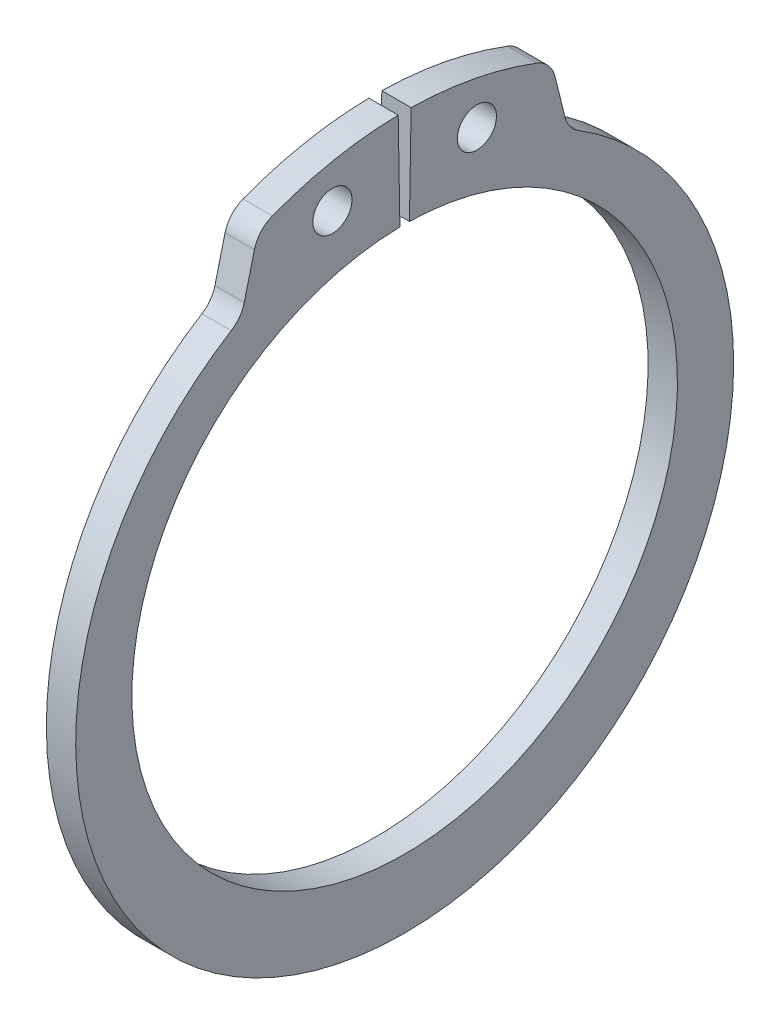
ISO-10303-21;
HEADER;
FILE_DESCRIPTION(('STEP AP214'),'2;1');
FILE_NAME('part.step','',(''),(''),'','','');
FILE_SCHEMA(('AUTOMOTIVE_DESIGN { 1 0 10303 214 1 1 1 1 }'));
ENDSEC;
DATA;
#1=APPLICATION_CONTEXT('core data for automotive mechanical design processes');
#2=APPLICATION_PROTOCOL_DEFINITION('international standard','automotive_design',2000,#1);
#3=PRODUCT_CONTEXT('',#1,'mechanical');
#4=PRODUCT('Part','Part','',(#3));
#5=PRODUCT_RELATED_PRODUCT_CATEGORY('part','',(#4));
#6=PRODUCT_DEFINITION_FORMATION('','',#4);
#7=PRODUCT_DEFINITION_CONTEXT('part definition',#1,'design');
#8=PRODUCT_DEFINITION('design','',#6,#7);
#9=PRODUCT_DEFINITION_SHAPE('','',#8);
#10=(LENGTH_UNIT() NAMED_UNIT(*) SI_UNIT(.MILLI.,.METRE.));
#11=(NAMED_UNIT(*) PLANE_ANGLE_UNIT() SI_UNIT($,.RADIAN.));
#12=(NAMED_UNIT(*) SI_UNIT($,.STERADIAN.) SOLID_ANGLE_UNIT());
#13=UNCERTAINTY_MEASURE_WITH_UNIT(LENGTH_MEASURE(1.E-05),#10,'distance_accuracy_value','');
#14=(GEOMETRIC_REPRESENTATION_CONTEXT(3) GLOBAL_UNCERTAINTY_ASSIGNED_CONTEXT((#13)) GLOBAL_UNIT_ASSIGNED_CONTEXT((#10,
#11,#12)) REPRESENTATION_CONTEXT('',''));
#15=CARTESIAN_POINT('',(0.,0.,0.));
#16=DIRECTION('',(0.,0.,1.));
#17=DIRECTION('',(1.,0.,0.));
#18=AXIS2_PLACEMENT_3D('',#15,#16,#17);
#19=CARTESIAN_POINT('',(0.75,0.,0.));
#20=DIRECTION('',(1.,0.,0.));
#21=DIRECTION('',(0.,0.,-1.));
#22=AXIS2_PLACEMENT_3D('',#19,#20,#21);
#23=PLANE('',#22);
#24=CARTESIAN_POINT('',(0.75,16.3880230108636,3.69421630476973));
#25=DIRECTION('',(1.,0.,0.));
#26=DIRECTION('',(0.,0.,-1.));
#27=AXIS2_PLACEMENT_3D('',#24,#25,#26);
#28=CIRCLE('',#27,1.);
#29=CARTESIAN_POINT('',(0.75,16.3880230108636,2.69421630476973));
#30=VERTEX_POINT('',#29);
#31=EDGE_CURVE('E245',#30,#30,#28,.T.);
#32=ORIENTED_EDGE('',*,*,#31,.F.);
#33=EDGE_LOOP('',(#32));
#34=FACE_BOUND('',#33,.T.);
#35=CARTESIAN_POINT('',(0.75,0.,0.));
#36=DIRECTION('',(1.,0.,0.));
#37=DIRECTION('',(0.,0.,-1.));
#38=AXIS2_PLACEMENT_3D('',#35,#36,#37);
#39=CIRCLE('',#38,18.95);
#40=CARTESIAN_POINT('',(0.75,18.9471138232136,0.330723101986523));
#41=VERTEX_POINT('',#40);
#42=CARTESIAN_POINT('',(0.75,17.7014090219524,6.76480736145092));
#43=VERTEX_POINT('',#42);
#44=EDGE_CURVE('E151',#41,#43,#39,.T.);
#45=ORIENTED_EDGE('',*,*,#44,.T.);
#46=CARTESIAN_POINT('',(0.75,16.3002420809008,6.22933448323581));
#47=DIRECTION('',(1.,0.,0.));
#48=DIRECTION('',(0.,0.,-1.));
#49=AXIS2_PLACEMENT_3D('',#46,#47,#48);
#50=CIRCLE('',#49,1.5);
#51=CARTESIAN_POINT('',(0.75,16.6631249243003,7.68477807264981));
#52=VERTEX_POINT('',#51);
#53=EDGE_CURVE('E192',#43,#52,#50,.T.);
#54=ORIENTED_EDGE('',*,*,#53,.T.);
#55=DIRECTION('',(0.,-0.970295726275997,0.241921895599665));
#56=VECTOR('',#55,1.);
#57=CARTESIAN_POINT('',(0.75,17.4024686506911,7.50043897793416));
#58=LINE('',#57,#56);
#59=CARTESIAN_POINT('',(0.75,14.5823120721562,8.2035829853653));
#60=VERTEX_POINT('',#59);
#61=EDGE_CURVE('E235',#52,#60,#58,.T.);
#62=ORIENTED_EDGE('',*,*,#61,.T.);
#63=CARTESIAN_POINT('',(0.75,14.9451949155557,9.65902657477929));
#64=DIRECTION('',(1.,0.,0.));
#65=DIRECTION('',(0.,0.,-1.));
#66=AXIS2_PLACEMENT_3D('',#63,#64,#65);
#67=CIRCLE('',#66,1.5);
#68=CARTESIAN_POINT('',(0.75,13.6705166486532,8.86833364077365));
#69=VERTEX_POINT('',#68);
#70=EDGE_CURVE('E204',#60,#69,#67,.F.);
#71=ORIENTED_EDGE('',*,*,#70,.T.);
#72=CARTESIAN_POINT('',(0.75,-0.626148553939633,0.));
#73=DIRECTION('',(1.,0.,0.));
#74=DIRECTION('',(0.,0.,-1.));
#75=AXIS2_PLACEMENT_3D('',#72,#73,#74);
#76=CIRCLE('',#75,16.8238514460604);
#77=CARTESIAN_POINT('',(0.75,13.6705166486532,-8.86833364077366));
#78=VERTEX_POINT('',#77);
#79=EDGE_CURVE('E228',#69,#78,#76,.T.);
#80=ORIENTED_EDGE('',*,*,#79,.T.);
#81=CARTESIAN_POINT('',(0.75,14.9451949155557,-9.6590265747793));
#82=DIRECTION('',(1.,0.,0.));
#83=DIRECTION('',(0.,0.,-1.));
#84=AXIS2_PLACEMENT_3D('',#81,#82,#83);
#85=CIRCLE('',#84,1.5);
#86=CARTESIAN_POINT('',(0.75,14.5823120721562,-8.20358298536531));
#87=VERTEX_POINT('',#86);
#88=EDGE_CURVE('E11',#78,#87,#85,.F.);
#89=ORIENTED_EDGE('',*,*,#88,.T.);
#90=DIRECTION('',(0.,0.970295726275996,0.241921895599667));
#91=VECTOR('',#90,1.);
#92=CARTESIAN_POINT('',(0.75,17.4024686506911,-7.50043897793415));
#93=LINE('',#92,#91);
#94=CARTESIAN_POINT('',(0.75,16.6631249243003,-7.6847780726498));
#95=VERTEX_POINT('',#94);
#96=EDGE_CURVE('E227',#87,#95,#93,.T.);
#97=ORIENTED_EDGE('',*,*,#96,.T.);
#98=CARTESIAN_POINT('',(0.75,16.3002420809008,-6.22933448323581));
#99=DIRECTION('',(1.,0.,0.));
#100=DIRECTION('',(0.,0.,-1.));
#101=AXIS2_PLACEMENT_3D('',#98,#99,#100);
#102=CIRCLE('',#101,1.5);
#103=CARTESIAN_POINT('',(0.75,17.7014090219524,-6.76480736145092));
#104=VERTEX_POINT('',#103);
#105=EDGE_CURVE('E59',#95,#104,#102,.T.);
#106=ORIENTED_EDGE('',*,*,#105,.T.);
#107=CARTESIAN_POINT('',(0.75,0.,0.));
#108=DIRECTION('',(1.,0.,0.));
#109=DIRECTION('',(0.,0.,1.));
#110=AXIS2_PLACEMENT_3D('',#107,#108,#109);
#111=CIRCLE('',#110,18.95);
#112=CARTESIAN_POINT('',(0.75,18.9471138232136,-0.330723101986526));
#113=VERTEX_POINT('',#112);
#114=EDGE_CURVE('E231',#104,#113,#111,.T.);
#115=ORIENTED_EDGE('',*,*,#114,.T.);
#116=DIRECTION('',(0.,-0.999847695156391,0.0174524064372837));
#117=VECTOR('',#116,1.);
#118=CARTESIAN_POINT('',(0.75,18.9471138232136,-0.330723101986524));
#119=LINE('',#118,#117);
#120=CARTESIAN_POINT('',(0.75,13.9478753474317,-0.243461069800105));
#121=VERTEX_POINT('',#120);
#122=EDGE_CURVE('E157',#113,#121,#119,.T.);
#123=ORIENTED_EDGE('',*,*,#122,.T.);
#124=CARTESIAN_POINT('',(0.75,0.,0.));
#125=DIRECTION('',(-1.,0.,0.));
#126=DIRECTION('',(0.,0.,-1.));
#127=AXIS2_PLACEMENT_3D('',#124,#125,#126);
#128=CIRCLE('',#127,13.95);
#129=CARTESIAN_POINT('',(0.75,13.9478753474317,0.243461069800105));
#130=VERTEX_POINT('',#129);
#131=EDGE_CURVE('E152',#121,#130,#128,.T.);
#132=ORIENTED_EDGE('',*,*,#131,.T.);
#133=DIRECTION('',(0.,0.999847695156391,0.0174524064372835));
#134=VECTOR('',#133,1.);
#135=CARTESIAN_POINT('',(0.75,13.9478753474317,0.243461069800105));
#136=LINE('',#135,#134);
#137=EDGE_CURVE('E140',#130,#41,#136,.T.);
#138=ORIENTED_EDGE('',*,*,#137,.T.);
#139=EDGE_LOOP('',(#45,#54,#62,#71,#80,#89,#97,#106,#115,#123,#132,#138));
#140=FACE_BOUND('',#139,.T.);
#141=CARTESIAN_POINT('',(0.75,16.3880230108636,-3.69421630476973));
#142=DIRECTION('',(1.,0.,0.));
#143=DIRECTION('',(0.,0.,-1.));
#144=AXIS2_PLACEMENT_3D('',#141,#142,#143);
#145=CIRCLE('',#144,1.);
#146=CARTESIAN_POINT('',(0.75,16.3880230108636,-4.69421630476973));
#147=VERTEX_POINT('',#146);
#148=EDGE_CURVE('E275',#147,#147,#145,.T.);
#149=ORIENTED_EDGE('',*,*,#148,.F.);
#150=EDGE_LOOP('',(#149));
#151=FACE_BOUND('',#150,.T.);
#152=ADVANCED_FACE('F43',(#34,#140,#151),#23,.T.);
#153=CARTESIAN_POINT('',(-0.75,0.,0.));
#154=DIRECTION('',(1.,0.,0.));
#155=DIRECTION('',(0.,0.,-1.));
#156=AXIS2_PLACEMENT_3D('',#153,#154,#155);
#157=PLANE('',#156);
#158=CARTESIAN_POINT('',(-0.75,16.3880230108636,3.69421630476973));
#159=DIRECTION('',(1.,0.,0.));
#160=DIRECTION('',(0.,0.,-1.));
#161=AXIS2_PLACEMENT_3D('',#158,#159,#160);
#162=CIRCLE('',#161,1.);
#163=CARTESIAN_POINT('',(-0.75,16.3880230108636,2.69421630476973));
#164=VERTEX_POINT('',#163);
#165=EDGE_CURVE('E272',#164,#164,#162,.T.);
#166=ORIENTED_EDGE('',*,*,#165,.T.);
#167=EDGE_LOOP('',(#166));
#168=FACE_BOUND('',#167,.T.);
#169=DIRECTION('',(0.,-0.970295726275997,0.241921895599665));
#170=VECTOR('',#169,1.);
#171=CARTESIAN_POINT('',(-0.75,17.4024686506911,7.50043897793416));
#172=LINE('',#171,#170);
#173=CARTESIAN_POINT('',(-0.75,16.6631249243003,7.68477807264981));
#174=VERTEX_POINT('',#173);
#175=CARTESIAN_POINT('',(-0.75,14.5823120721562,8.2035829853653));
#176=VERTEX_POINT('',#175);
#177=EDGE_CURVE('E224',#174,#176,#172,.T.);
#178=ORIENTED_EDGE('',*,*,#177,.F.);
#179=CARTESIAN_POINT('',(-0.75,16.3002420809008,6.22933448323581));
#180=DIRECTION('',(1.,0.,0.));
#181=DIRECTION('',(0.,0.,-1.));
#182=AXIS2_PLACEMENT_3D('',#179,#180,#181);
#183=CIRCLE('',#182,1.5);
#184=CARTESIAN_POINT('',(-0.75,17.7014090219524,6.76480736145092));
#185=VERTEX_POINT('',#184);
#186=EDGE_CURVE('E187',#174,#185,#183,.F.);
#187=ORIENTED_EDGE('',*,*,#186,.T.);
#188=CARTESIAN_POINT('',(-0.75,0.,0.));
#189=DIRECTION('',(1.,0.,0.));
#190=DIRECTION('',(0.,0.,-1.));
#191=AXIS2_PLACEMENT_3D('',#188,#189,#190);
#192=CIRCLE('',#191,18.95);
#193=CARTESIAN_POINT('',(-0.75,18.9471138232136,0.330723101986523));
#194=VERTEX_POINT('',#193);
#195=EDGE_CURVE('E247',#194,#185,#192,.T.);
#196=ORIENTED_EDGE('',*,*,#195,.F.);
#197=DIRECTION('',(0.,0.999847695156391,0.0174524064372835));
#198=VECTOR('',#197,1.);
#199=CARTESIAN_POINT('',(-0.75,13.9478753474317,0.243461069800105));
#200=LINE('',#199,#198);
#201=CARTESIAN_POINT('',(-0.75,13.9478753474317,0.243461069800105));
#202=VERTEX_POINT('',#201);
#203=EDGE_CURVE('E244',#202,#194,#200,.T.);
#204=ORIENTED_EDGE('',*,*,#203,.F.);
#205=CARTESIAN_POINT('',(-0.75,0.,0.));
#206=DIRECTION('',(-1.,0.,0.));
#207=DIRECTION('',(0.,0.,-1.));
#208=AXIS2_PLACEMENT_3D('',#205,#206,#207);
#209=CIRCLE('',#208,13.95);
#210=CARTESIAN_POINT('',(-0.75,13.9478753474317,-0.243461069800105));
#211=VERTEX_POINT('',#210);
#212=EDGE_CURVE('E166',#211,#202,#209,.T.);
#213=ORIENTED_EDGE('',*,*,#212,.F.);
#214=DIRECTION('',(0.,-0.999847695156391,0.0174524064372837));
#215=VECTOR('',#214,1.);
#216=CARTESIAN_POINT('',(-0.75,18.9471138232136,-0.330723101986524));
#217=LINE('',#216,#215);
#218=CARTESIAN_POINT('',(-0.75,18.9471138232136,-0.330723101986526));
#219=VERTEX_POINT('',#218);
#220=EDGE_CURVE('E162',#219,#211,#217,.T.);
#221=ORIENTED_EDGE('',*,*,#220,.F.);
#222=CARTESIAN_POINT('',(-0.75,0.,0.));
#223=DIRECTION('',(1.,0.,0.));
#224=DIRECTION('',(0.,0.,1.));
#225=AXIS2_PLACEMENT_3D('',#222,#223,#224);
#226=CIRCLE('',#225,18.95);
#227=CARTESIAN_POINT('',(-0.75,17.7014090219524,-6.76480736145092));
#228=VERTEX_POINT('',#227);
#229=EDGE_CURVE('E254',#228,#219,#226,.T.);
#230=ORIENTED_EDGE('',*,*,#229,.F.);
#231=CARTESIAN_POINT('',(-0.75,16.3002420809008,-6.22933448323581));
#232=DIRECTION('',(1.,0.,0.));
#233=DIRECTION('',(0.,0.,-1.));
#234=AXIS2_PLACEMENT_3D('',#231,#232,#233);
#235=CIRCLE('',#234,1.5);
#236=CARTESIAN_POINT('',(-0.75,16.6631249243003,-7.6847780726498));
#237=VERTEX_POINT('',#236);
#238=EDGE_CURVE('E185',#228,#237,#235,.F.);
#239=ORIENTED_EDGE('',*,*,#238,.T.);
#240=DIRECTION('',(0.,0.970295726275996,0.241921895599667));
#241=VECTOR('',#240,1.);
#242=CARTESIAN_POINT('',(-0.75,17.4024686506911,-7.50043897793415));
#243=LINE('',#242,#241);
#244=CARTESIAN_POINT('',(-0.75,14.5823120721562,-8.20358298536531));
#245=VERTEX_POINT('',#244);
#246=EDGE_CURVE('E214',#245,#237,#243,.T.);
#247=ORIENTED_EDGE('',*,*,#246,.F.);
#248=CARTESIAN_POINT('',(-0.75,14.9451949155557,-9.6590265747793));
#249=DIRECTION('',(1.,0.,0.));
#250=DIRECTION('',(0.,0.,-1.));
#251=AXIS2_PLACEMENT_3D('',#248,#249,#250);
#252=CIRCLE('',#251,1.5);
#253=CARTESIAN_POINT('',(-0.75,13.6705166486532,-8.86833364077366));
#254=VERTEX_POINT('',#253);
#255=EDGE_CURVE('E52',#245,#254,#252,.T.);
#256=ORIENTED_EDGE('',*,*,#255,.T.);
#257=CARTESIAN_POINT('',(-0.75,-0.626148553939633,0.));
#258=DIRECTION('',(1.,0.,0.));
#259=DIRECTION('',(0.,0.,-1.));
#260=AXIS2_PLACEMENT_3D('',#257,#258,#259);
#261=CIRCLE('',#260,16.8238514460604);
#262=CARTESIAN_POINT('',(-0.75,13.6705166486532,8.86833364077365));
#263=VERTEX_POINT('',#262);
#264=EDGE_CURVE('E213',#263,#254,#261,.T.);
#265=ORIENTED_EDGE('',*,*,#264,.F.);
#266=CARTESIAN_POINT('',(-0.75,14.9451949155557,9.65902657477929));
#267=DIRECTION('',(1.,0.,0.));
#268=DIRECTION('',(0.,0.,-1.));
#269=AXIS2_PLACEMENT_3D('',#266,#267,#268);
#270=CIRCLE('',#269,1.5);
#271=EDGE_CURVE('E202',#263,#176,#270,.T.);
#272=ORIENTED_EDGE('',*,*,#271,.T.);
#273=EDGE_LOOP('',(#178,#187,#196,#204,#213,#221,#230,#239,#247,#256,#265,#272));
#274=FACE_BOUND('',#273,.T.);
#275=CARTESIAN_POINT('',(-0.75,16.3880230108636,-3.69421630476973));
#276=DIRECTION('',(1.,0.,0.));
#277=DIRECTION('',(0.,0.,-1.));
#278=AXIS2_PLACEMENT_3D('',#275,#276,#277);
#279=CIRCLE('',#278,1.);
#280=CARTESIAN_POINT('',(-0.75,16.3880230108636,-4.69421630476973));
#281=VERTEX_POINT('',#280);
#282=EDGE_CURVE('E278',#281,#281,#279,.T.);
#283=ORIENTED_EDGE('',*,*,#282,.T.);
#284=EDGE_LOOP('',(#283));
#285=FACE_BOUND('',#284,.T.);
#286=ADVANCED_FACE('F211',(#168,#274,#285),#157,.F.);
#287=CARTESIAN_POINT('',(0.75,0.,0.));
#288=DIRECTION('',(-1.,0.,0.));
#289=DIRECTION('',(0.,0.,1.));
#290=AXIS2_PLACEMENT_3D('',#287,#288,#289);
#291=CYLINDRICAL_SURFACE('',#290,13.95);
#292=ORIENTED_EDGE('',*,*,#212,.T.);
#293=DIRECTION('',(-1.,0.,0.));
#294=VECTOR('',#293,1.);
#295=CARTESIAN_POINT('',(0.75,13.9478753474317,0.243461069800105));
#296=LINE('',#295,#294);
#297=EDGE_CURVE('E144',#130,#202,#296,.T.);
#298=ORIENTED_EDGE('',*,*,#297,.F.);
#299=ORIENTED_EDGE('',*,*,#131,.F.);
#300=DIRECTION('',(-1.,0.,0.));
#301=VECTOR('',#300,1.);
#302=CARTESIAN_POINT('',(0.75,13.9478753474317,-0.243461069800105));
#303=LINE('',#302,#301);
#304=EDGE_CURVE('E241',#121,#211,#303,.T.);
#305=ORIENTED_EDGE('',*,*,#304,.T.);
#306=EDGE_LOOP('',(#292,#298,#299,#305));
#307=FACE_BOUND('',#306,.T.);
#308=ADVANCED_FACE('F164',(#307),#291,.F.);
#309=CARTESIAN_POINT('',(0.75,13.9478753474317,0.243461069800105));
#310=DIRECTION('',(0.,-0.0174524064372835,0.999847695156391));
#311=DIRECTION('',(0.,-0.999847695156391,-0.0174524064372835));
#312=AXIS2_PLACEMENT_3D('',#309,#310,#311);
#313=PLANE('',#312);
#314=ORIENTED_EDGE('',*,*,#203,.T.);
#315=DIRECTION('',(-1.,0.,0.));
#316=VECTOR('',#315,1.);
#317=CARTESIAN_POINT('',(0.75,18.9471138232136,0.330723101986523));
#318=LINE('',#317,#316);
#319=EDGE_CURVE('E147',#41,#194,#318,.T.);
#320=ORIENTED_EDGE('',*,*,#319,.F.);
#321=ORIENTED_EDGE('',*,*,#137,.F.);
#322=ORIENTED_EDGE('',*,*,#297,.T.);
#323=EDGE_LOOP('',(#314,#320,#321,#322));
#324=FACE_BOUND('',#323,.T.);
#325=ADVANCED_FACE('F142',(#324),#313,.F.);
#326=CARTESIAN_POINT('',(0.75,0.,0.));
#327=DIRECTION('',(-1.,0.,0.));
#328=DIRECTION('',(0.,0.,1.));
#329=AXIS2_PLACEMENT_3D('',#326,#327,#328);
#330=CYLINDRICAL_SURFACE('',#329,18.95);
#331=ORIENTED_EDGE('',*,*,#195,.T.);
#332=DIRECTION('',(-1.,0.,0.));
#333=VECTOR('',#332,1.);
#334=CARTESIAN_POINT('',(0.75,17.7014090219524,6.76480736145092));
#335=LINE('',#334,#333);
#336=EDGE_CURVE('E189',#185,#43,#335,.F.);
#337=ORIENTED_EDGE('',*,*,#336,.T.);
#338=ORIENTED_EDGE('',*,*,#44,.F.);
#339=ORIENTED_EDGE('',*,*,#319,.T.);
#340=EDGE_LOOP('',(#331,#337,#338,#339));
#341=FACE_BOUND('',#340,.T.);
#342=ADVANCED_FACE('F266',(#341),#330,.T.);
#343=CARTESIAN_POINT('',(0.75,17.4024686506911,7.50043897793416));
#344=DIRECTION('',(0.,-0.241921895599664,-0.970295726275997));
#345=DIRECTION('',(0.,0.970295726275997,-0.241921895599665));
#346=AXIS2_PLACEMENT_3D('',#343,#344,#345);
#347=PLANE('',#346);
#348=ORIENTED_EDGE('',*,*,#177,.T.);
#349=DIRECTION('',(1.,0.,0.));
#350=VECTOR('',#349,1.);
#351=CARTESIAN_POINT('',(0.75,14.5823120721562,8.2035829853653));
#352=LINE('',#351,#350);
#353=EDGE_CURVE('E183',#176,#60,#352,.T.);
#354=ORIENTED_EDGE('',*,*,#353,.T.);
#355=ORIENTED_EDGE('',*,*,#61,.F.);
#356=DIRECTION('',(-1.,0.,0.));
#357=VECTOR('',#356,1.);
#358=CARTESIAN_POINT('',(0.75,16.6631249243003,7.68477807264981));
#359=LINE('',#358,#357);
#360=EDGE_CURVE('E180',#52,#174,#359,.T.);
#361=ORIENTED_EDGE('',*,*,#360,.T.);
#362=EDGE_LOOP('',(#348,#354,#355,#361));
#363=FACE_BOUND('',#362,.T.);
#364=ADVANCED_FACE('F308',(#363),#347,.F.);
#365=CARTESIAN_POINT('',(0.75,-0.626148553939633,0.));
#366=DIRECTION('',(-1.,0.,0.));
#367=DIRECTION('',(0.,0.,1.));
#368=AXIS2_PLACEMENT_3D('',#365,#366,#367);
#369=CYLINDRICAL_SURFACE('',#368,16.8238514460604);
#370=ORIENTED_EDGE('',*,*,#79,.F.);
#371=DIRECTION('',(-1.,0.,0.));
#372=VECTOR('',#371,1.);
#373=CARTESIAN_POINT('',(0.75,13.6705166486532,8.86833364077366));
#374=LINE('',#373,#372);
#375=EDGE_CURVE('E172',#69,#263,#374,.T.);
#376=ORIENTED_EDGE('',*,*,#375,.T.);
#377=ORIENTED_EDGE('',*,*,#264,.T.);
#378=DIRECTION('',(-1.,0.,0.));
#379=VECTOR('',#378,1.);
#380=CARTESIAN_POINT('',(0.75,13.6705166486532,-8.86833364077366));
#381=LINE('',#380,#379);
#382=EDGE_CURVE('E168',#254,#78,#381,.F.);
#383=ORIENTED_EDGE('',*,*,#382,.T.);
#384=EDGE_LOOP('',(#370,#376,#377,#383));
#385=FACE_BOUND('',#384,.T.);
#386=ADVANCED_FACE('F220',(#385),#369,.T.);
#387=CARTESIAN_POINT('',(0.75,17.4024686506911,-7.50043897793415));
#388=DIRECTION('',(0.,-0.241921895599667,0.970295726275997));
#389=DIRECTION('',(0.,-0.970295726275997,-0.241921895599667));
#390=AXIS2_PLACEMENT_3D('',#387,#388,#389);
#391=PLANE('',#390);
#392=ORIENTED_EDGE('',*,*,#246,.T.);
#393=DIRECTION('',(-1.,0.,0.));
#394=VECTOR('',#393,1.);
#395=CARTESIAN_POINT('',(0.75,16.6631249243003,-7.6847780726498));
#396=LINE('',#395,#394);
#397=EDGE_CURVE('E67',#237,#95,#396,.F.);
#398=ORIENTED_EDGE('',*,*,#397,.T.);
#399=ORIENTED_EDGE('',*,*,#96,.F.);
#400=DIRECTION('',(1.,0.,0.));
#401=VECTOR('',#400,1.);
#402=CARTESIAN_POINT('',(-0.75,14.5823120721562,-8.20358298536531));
#403=LINE('',#402,#401);
#404=EDGE_CURVE('E197',#87,#245,#403,.F.);
#405=ORIENTED_EDGE('',*,*,#404,.T.);
#406=EDGE_LOOP('',(#392,#398,#399,#405));
#407=FACE_BOUND('',#406,.T.);
#408=ADVANCED_FACE('F229',(#407),#391,.F.);
#409=CARTESIAN_POINT('',(0.75,0.,0.));
#410=DIRECTION('',(-1.,0.,0.));
#411=DIRECTION('',(0.,0.,1.));
#412=AXIS2_PLACEMENT_3D('',#409,#410,#411);
#413=CYLINDRICAL_SURFACE('',#412,18.95);
#414=ORIENTED_EDGE('',*,*,#114,.F.);
#415=DIRECTION('',(-1.,0.,0.));
#416=VECTOR('',#415,1.);
#417=CARTESIAN_POINT('',(0.75,17.7014090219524,-6.76480736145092));
#418=LINE('',#417,#416);
#419=EDGE_CURVE('E194',#104,#228,#418,.T.);
#420=ORIENTED_EDGE('',*,*,#419,.T.);
#421=ORIENTED_EDGE('',*,*,#229,.T.);
#422=DIRECTION('',(-1.,0.,0.));
#423=VECTOR('',#422,1.);
#424=CARTESIAN_POINT('',(0.75,18.9471138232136,-0.330723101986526));
#425=LINE('',#424,#423);
#426=EDGE_CURVE('E174',#113,#219,#425,.T.);
#427=ORIENTED_EDGE('',*,*,#426,.F.);
#428=EDGE_LOOP('',(#414,#420,#421,#427));
#429=FACE_BOUND('',#428,.T.);
#430=ADVANCED_FACE('F301',(#429),#413,.T.);
#431=CARTESIAN_POINT('',(0.75,18.9471138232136,-0.330723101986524));
#432=DIRECTION('',(0.,-0.0174524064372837,-0.999847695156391));
#433=DIRECTION('',(0.,0.999847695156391,-0.0174524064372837));
#434=AXIS2_PLACEMENT_3D('',#431,#432,#433);
#435=PLANE('',#434);
#436=ORIENTED_EDGE('',*,*,#220,.T.);
#437=ORIENTED_EDGE('',*,*,#304,.F.);
#438=ORIENTED_EDGE('',*,*,#122,.F.);
#439=ORIENTED_EDGE('',*,*,#426,.T.);
#440=EDGE_LOOP('',(#436,#437,#438,#439));
#441=FACE_BOUND('',#440,.T.);
#442=ADVANCED_FACE('F261',(#441),#435,.F.);
#443=CARTESIAN_POINT('',(0.75,16.3880230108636,3.69421630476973));
#444=DIRECTION('',(-1.,0.,0.));
#445=DIRECTION('',(0.,0.,1.));
#446=AXIS2_PLACEMENT_3D('',#443,#444,#445);
#447=CYLINDRICAL_SURFACE('',#446,1.);
#448=ORIENTED_EDGE('',*,*,#31,.T.);
#449=EDGE_LOOP('',(#448));
#450=FACE_BOUND('',#449,.T.);
#451=ORIENTED_EDGE('',*,*,#165,.F.);
#452=EDGE_LOOP('',(#451));
#453=FACE_BOUND('',#452,.T.);
#454=ADVANCED_FACE('F296',(#450,#453),#447,.F.);
#455=CARTESIAN_POINT('',(0.75,16.3880230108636,-3.69421630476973));
#456=DIRECTION('',(-1.,0.,0.));
#457=DIRECTION('',(0.,0.,1.));
#458=AXIS2_PLACEMENT_3D('',#455,#456,#457);
#459=CYLINDRICAL_SURFACE('',#458,1.);
#460=ORIENTED_EDGE('',*,*,#148,.T.);
#461=EDGE_LOOP('',(#460));
#462=FACE_BOUND('',#461,.T.);
#463=ORIENTED_EDGE('',*,*,#282,.F.);
#464=EDGE_LOOP('',(#463));
#465=FACE_BOUND('',#464,.T.);
#466=ADVANCED_FACE('F284',(#462,#465),#459,.F.);
#467=CARTESIAN_POINT('',(0.75,14.9451949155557,9.65902657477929));
#468=DIRECTION('',(-1.,0.,0.));
#469=DIRECTION('',(0.,0.,1.));
#470=AXIS2_PLACEMENT_3D('',#467,#468,#469);
#471=CYLINDRICAL_SURFACE('',#470,1.5);
#472=ORIENTED_EDGE('',*,*,#70,.F.);
#473=ORIENTED_EDGE('',*,*,#353,.F.);
#474=ORIENTED_EDGE('',*,*,#271,.F.);
#475=ORIENTED_EDGE('',*,*,#375,.F.);
#476=EDGE_LOOP('',(#472,#473,#474,#475));
#477=FACE_BOUND('',#476,.T.);
#478=ADVANCED_FACE('F318',(#477),#471,.F.);
#479=CARTESIAN_POINT('',(0.75,16.3002420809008,6.22933448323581));
#480=DIRECTION('',(-1.,0.,0.));
#481=DIRECTION('',(0.,0.,1.));
#482=AXIS2_PLACEMENT_3D('',#479,#480,#481);
#483=CYLINDRICAL_SURFACE('',#482,1.5);
#484=ORIENTED_EDGE('',*,*,#53,.F.);
#485=ORIENTED_EDGE('',*,*,#336,.F.);
#486=ORIENTED_EDGE('',*,*,#186,.F.);
#487=ORIENTED_EDGE('',*,*,#360,.F.);
#488=EDGE_LOOP('',(#484,#485,#486,#487));
#489=FACE_BOUND('',#488,.T.);
#490=ADVANCED_FACE('F321',(#489),#483,.T.);
#491=CARTESIAN_POINT('',(0.75,16.3002420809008,-6.22933448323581));
#492=DIRECTION('',(-1.,0.,0.));
#493=DIRECTION('',(0.,0.,1.));
#494=AXIS2_PLACEMENT_3D('',#491,#492,#493);
#495=CYLINDRICAL_SURFACE('',#494,1.5);
#496=ORIENTED_EDGE('',*,*,#105,.F.);
#497=ORIENTED_EDGE('',*,*,#397,.F.);
#498=ORIENTED_EDGE('',*,*,#238,.F.);
#499=ORIENTED_EDGE('',*,*,#419,.F.);
#500=EDGE_LOOP('',(#496,#497,#498,#499));
#501=FACE_BOUND('',#500,.T.);
#502=ADVANCED_FACE('F324',(#501),#495,.T.);
#503=CARTESIAN_POINT('',(0.75,14.9451949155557,-9.6590265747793));
#504=DIRECTION('',(-1.,0.,0.));
#505=DIRECTION('',(0.,0.,1.));
#506=AXIS2_PLACEMENT_3D('',#503,#504,#505);
#507=CYLINDRICAL_SURFACE('',#506,1.5);
#508=ORIENTED_EDGE('',*,*,#88,.F.);
#509=ORIENTED_EDGE('',*,*,#382,.F.);
#510=ORIENTED_EDGE('',*,*,#255,.F.);
#511=ORIENTED_EDGE('',*,*,#404,.F.);
#512=EDGE_LOOP('',(#508,#509,#510,#511));
#513=FACE_BOUND('',#512,.T.);
#514=ADVANCED_FACE('F45',(#513),#507,.F.);
#515=CLOSED_SHELL('',(#152,#286,#308,#325,#342,#364,#386,#408,#430,#442,#454,#466,#478,#490,
#502,#514));
#516=MANIFOLD_SOLID_BREP('B2',#515);
#517=ADVANCED_BREP_SHAPE_REPRESENTATION('',(#18,#516),#14);
#518=SHAPE_DEFINITION_REPRESENTATION(#9,#517);
ENDSEC;
END-ISO-10303-21;
